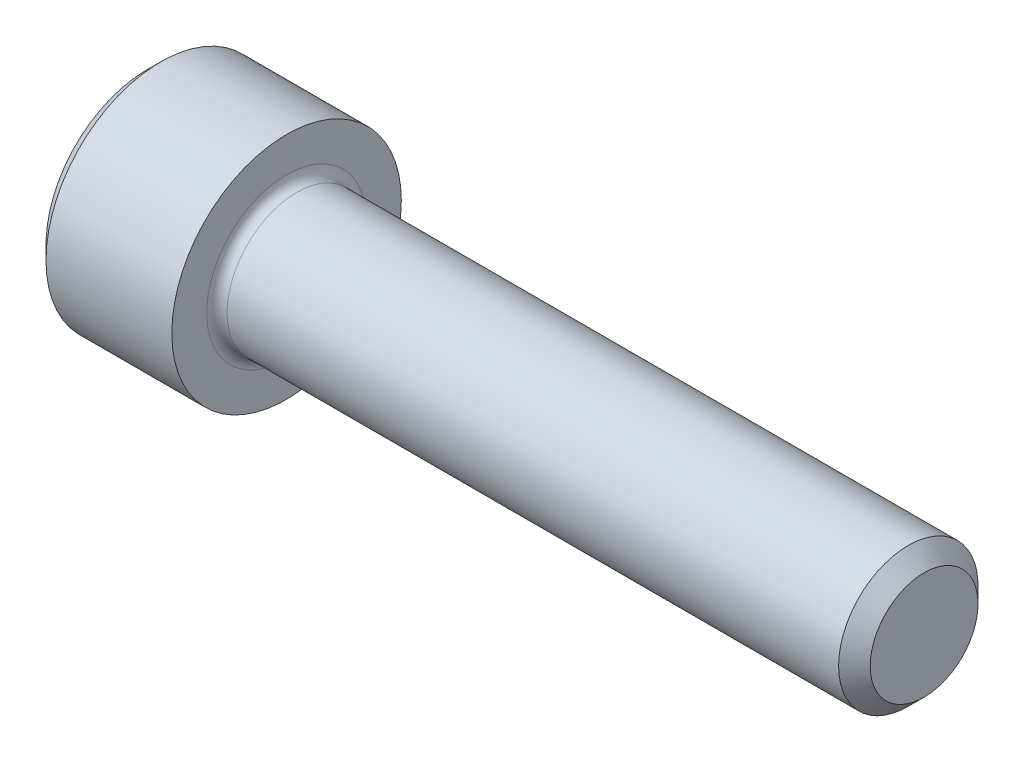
from build123d import *

# Parameters (mm, degrees)
FILLET1_R   = 0.3048
HEX_2_DEPTH = 1.9558


with BuildPart() as part:
    # BodySke → Base-Revolve (revolve)
    with BuildSketch(Plane.XY, mode=Mode.PRIVATE) as base_revolve_sk:
        Polygon((0, 0), (0, 3.0226), (0.4064, 3.429), (4.1656, 3.429), (4.1656, 2.0828), (22.74316, 2.0828), (23.2156, 1.61036), (23.2156, 0), align=None)
    revolve(base_revolve_sk.sketch.rotate(Axis((-31.75, 0, 0), (1, 0, 0)), 90), axis=Axis((-31.75, 0, 0), (1, 0, 0)))

    # Fillet1
    fillet1_edges = [part.edges().sort_by_distance(p)[0] for p in [
        (4.1656, 0, -2.0828),
    ]]
    fillet(fillet1_edges, radius=FILLET1_R)

    # Sketch2 → Hex-PreBroach (revolve, cut)
    with BuildSketch(Plane.XY, mode=Mode.PRIVATE) as hex_prebroach_sk:
        Polygon((0, 1.778), (1.9558, 1.778), (2.982328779, 0), (0, 0), align=None)
    revolve(hex_prebroach_sk.sketch.rotate(Axis((0, 0, 0), (1, 0, 0)), 90), axis=Axis((0, 0, 0), (1, 0, 0)), mode=Mode.SUBTRACT)

    # Sketch3 → Hex 2 (cut)
    with BuildSketch(Plane(origin=(0, 0, 0), x_dir=(0, 0.500000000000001, 0.866025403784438), z_dir=(-1, 0, 0))):
        Polygon((1.026528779, 1.778), (-1.026528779, 1.778), (-2.053057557, 0), (-1.026528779, -1.778), (1.026528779, -1.778), (2.053057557, 0), align=None)
    extrude(amount=-HEX_2_DEPTH, mode=Mode.SUBTRACT)


solid = part.part
